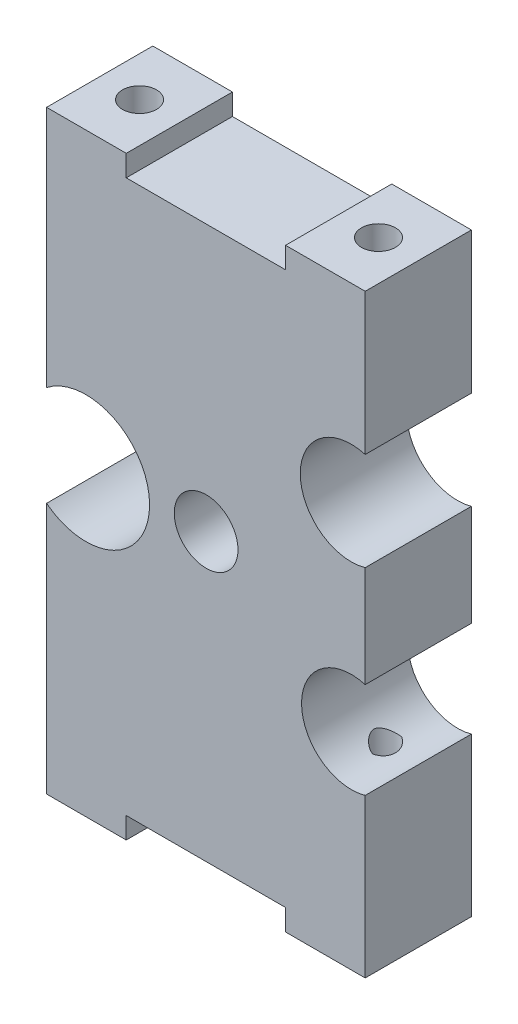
from build123d import *

# Parameters (mm, degrees)
SCHIZZO1_R                   = 6
ESTRUSIONE_ESTRUSIONE1_DEPTH = 20
FORO_PER_VITE_M6_1_D         = 6.4
FORO_PER_VITE_M6_1_DEPTH     = 30
FORO_PER_VITE_M6_1_TIP       = 1.922753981
FORO_PER_VITE_M6_2_D         = 6.4
FORO_PER_VITE_M6_2_DEPTH     = 30
FORO_PER_VITE_M6_2_TIP       = 1.922753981
FORO_PER_VITE_M6_4_D         = 6.4
FORO_PER_VITE_M6_4_DEPTH     = 30
FORO_PER_VITE_M6_4_TIP       = 1.922753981


with BuildPart() as part:
    # Schizzo1 → Estrusione-Estrusione1 (new body)
    with BuildSketch(Plane.XY):
        with BuildLine():
            Line((-29.737815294, 8.903274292), (-29.737815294, 54.610853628))
            Line((-29.737815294, 54.610853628), (-14.737815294, 54.610853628))
            Line((-14.737815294, 54.610853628), (-14.737815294, 50.610853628))
            Line((-14.737815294, 50.610853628), (15.262184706, 50.610853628))
            Line((15.262184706, 50.610853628), (15.262184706, 54.610853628))
            Line((15.262184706, 54.610853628), (30.262184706, 54.610853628))
            Line((30.262184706, 54.610853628), (30.262184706, 27.991378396))
            ThreePointArc((30.262184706, 27.991378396), (18.038375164, 18.76346731), (30.262184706, 9.535556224))
            Line((30.262184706, 9.535556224), (30.262184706, -9.543500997))
            ThreePointArc((30.262184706, -9.543500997), (18.274366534, -18.575342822), (30.262184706, -27.607184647))
            Line((30.262184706, -27.607184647), (30.262184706, -57.389146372))
            Line((30.262184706, -57.389146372), (15.262184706, -57.389146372))
            Line((15.262184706, -57.389146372), (15.262184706, -53.389146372))
            Line((15.262184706, -53.389146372), (-14.737815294, -53.389146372))
            Line((-14.737815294, -53.389146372), (-14.737815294, -57.389146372))
            Line((-14.737815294, -57.389146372), (-29.737815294, -57.389146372))
            Line((-29.737815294, -57.389146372), (-29.737815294, -9.969540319))
            ThreePointArc((-29.737815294, -9.969540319), (-10.342271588, -0.533133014), (-29.737815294, 8.903274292))
        make_face()
        with Locations((0.301417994, 0.458443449)):
            Circle(SCHIZZO1_R, mode=Mode.SUBTRACT)
    extrude(amount=ESTRUSIONE_ESTRUSIONE1_DEPTH)

    # Foro per Vite M6-1
    with Locations(Plane(origin=(0, -57.389146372, 0), x_dir=(-1, 0, 0), z_dir=(0, -1, 0))):
        with Locations((22.237815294, -10)):
            Hole(FORO_PER_VITE_M6_1_D / 2, depth=FORO_PER_VITE_M6_1_DEPTH)
            with Locations((0, 0, -(FORO_PER_VITE_M6_1_DEPTH + FORO_PER_VITE_M6_1_TIP / 2))):  # 118° drill point
                Cone(0, FORO_PER_VITE_M6_1_D / 2, FORO_PER_VITE_M6_1_TIP, mode=Mode.SUBTRACT)

    # Foro per Vite M6-2
    with Locations(Plane(origin=(0, -57.389146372, 0), x_dir=(-1, 0, 0), z_dir=(0, -1, 0))):
        with Locations((-22.762184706, -10)):
            Hole(FORO_PER_VITE_M6_2_D / 2, depth=FORO_PER_VITE_M6_2_DEPTH)
            with Locations((0, 0, -(FORO_PER_VITE_M6_2_DEPTH + FORO_PER_VITE_M6_2_TIP / 2))):  # 118° drill point
                Cone(0, FORO_PER_VITE_M6_2_D / 2, FORO_PER_VITE_M6_2_TIP, mode=Mode.SUBTRACT)

    # Foro per Vite M6-4
    with Locations(Plane(origin=(0, 54.610853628, 0), x_dir=(1, 0, 0), z_dir=(0, 1, 0))):
        with Locations((-22.237815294, -10), (22.762184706, -10)):
            Hole(FORO_PER_VITE_M6_4_D / 2, depth=FORO_PER_VITE_M6_4_DEPTH)
            with Locations((0, 0, -(FORO_PER_VITE_M6_4_DEPTH + FORO_PER_VITE_M6_4_TIP / 2))):  # 118° drill point
                Cone(0, FORO_PER_VITE_M6_4_D / 2, FORO_PER_VITE_M6_4_TIP, mode=Mode.SUBTRACT)


solid = part.part
